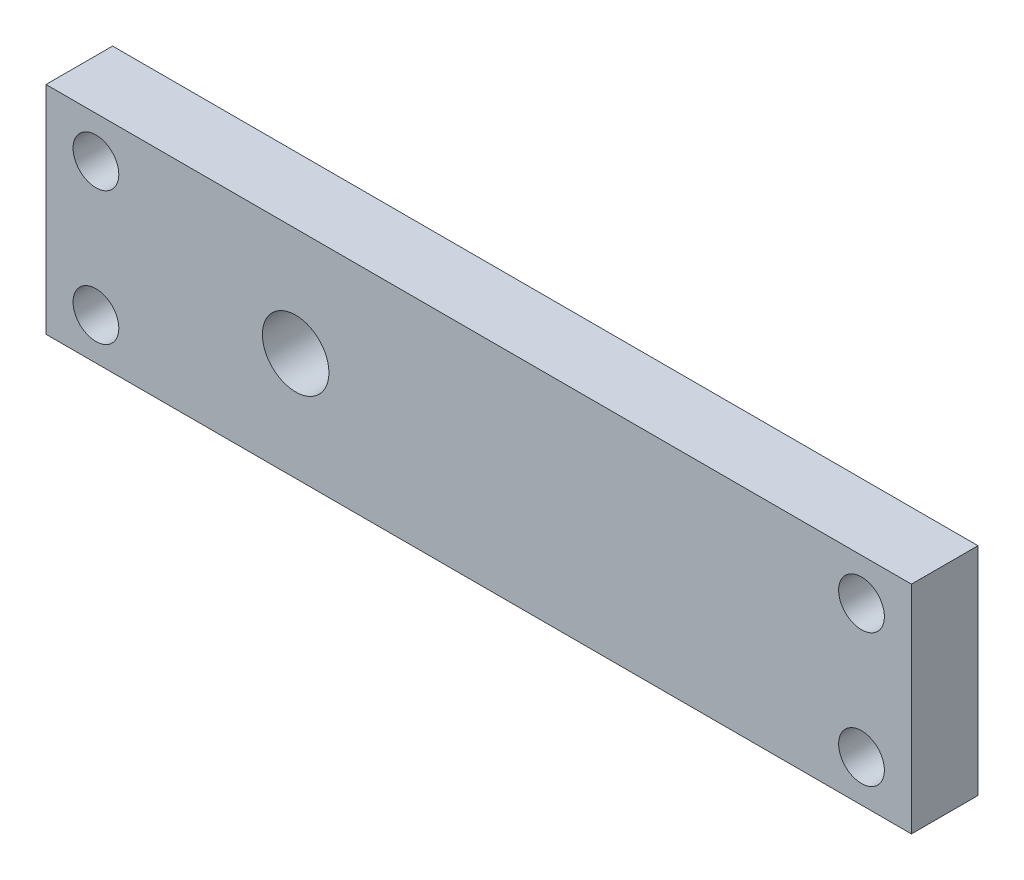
ISO-10303-21;
HEADER;
FILE_DESCRIPTION(('STEP AP214'),'2;1');
FILE_NAME('part.step','',(''),(''),'','','');
FILE_SCHEMA(('AUTOMOTIVE_DESIGN { 1 0 10303 214 1 1 1 1 }'));
ENDSEC;
DATA;
#1=APPLICATION_CONTEXT('core data for automotive mechanical design processes');
#2=APPLICATION_PROTOCOL_DEFINITION('international standard','automotive_design',2000,#1);
#3=PRODUCT_CONTEXT('',#1,'mechanical');
#4=PRODUCT('Part','Part','',(#3));
#5=PRODUCT_RELATED_PRODUCT_CATEGORY('part','',(#4));
#6=PRODUCT_DEFINITION_FORMATION('','',#4);
#7=PRODUCT_DEFINITION_CONTEXT('part definition',#1,'design');
#8=PRODUCT_DEFINITION('design','',#6,#7);
#9=PRODUCT_DEFINITION_SHAPE('','',#8);
#10=(LENGTH_UNIT() NAMED_UNIT(*) SI_UNIT(.MILLI.,.METRE.));
#11=(NAMED_UNIT(*) PLANE_ANGLE_UNIT() SI_UNIT($,.RADIAN.));
#12=(NAMED_UNIT(*) SI_UNIT($,.STERADIAN.) SOLID_ANGLE_UNIT());
#13=UNCERTAINTY_MEASURE_WITH_UNIT(LENGTH_MEASURE(1.E-05),#10,'distance_accuracy_value','');
#14=(GEOMETRIC_REPRESENTATION_CONTEXT(3) GLOBAL_UNCERTAINTY_ASSIGNED_CONTEXT((#13)) GLOBAL_UNIT_ASSIGNED_CONTEXT((#10,
#11,#12)) REPRESENTATION_CONTEXT('',''));
#15=CARTESIAN_POINT('',(0.,0.,0.));
#16=DIRECTION('',(0.,0.,1.));
#17=DIRECTION('',(1.,0.,0.));
#18=AXIS2_PLACEMENT_3D('',#15,#16,#17);
#19=CARTESIAN_POINT('',(0.,0.,8.00000000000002));
#20=DIRECTION('',(1.,0.,0.));
#21=DIRECTION('',(0.,0.,-1.));
#22=AXIS2_PLACEMENT_3D('',#19,#20,#21);
#23=PLANE('',#22);
#24=DIRECTION('',(0.,-1.,0.));
#25=VECTOR('',#24,1.);
#26=CARTESIAN_POINT('',(0.,0.,0.));
#27=LINE('',#26,#25);
#28=CARTESIAN_POINT('',(0.,26.,0.));
#29=VERTEX_POINT('',#28);
#30=CARTESIAN_POINT('',(0.,0.,0.));
#31=VERTEX_POINT('',#30);
#32=EDGE_CURVE('E96',#29,#31,#27,.T.);
#33=ORIENTED_EDGE('',*,*,#32,.T.);
#34=DIRECTION('',(0.,0.,-1.));
#35=VECTOR('',#34,1.);
#36=CARTESIAN_POINT('',(0.,0.,8.00000000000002));
#37=LINE('',#36,#35);
#38=CARTESIAN_POINT('',(0.,0.,8.00000000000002));
#39=VERTEX_POINT('',#38);
#40=EDGE_CURVE('E11',#39,#31,#37,.T.);
#41=ORIENTED_EDGE('',*,*,#40,.F.);
#42=DIRECTION('',(0.,-1.,0.));
#43=VECTOR('',#42,1.);
#44=CARTESIAN_POINT('',(0.,0.,8.00000000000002));
#45=LINE('',#44,#43);
#46=CARTESIAN_POINT('',(0.,26.,8.00000000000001));
#47=VERTEX_POINT('',#46);
#48=EDGE_CURVE('E83',#47,#39,#45,.T.);
#49=ORIENTED_EDGE('',*,*,#48,.F.);
#50=DIRECTION('',(0.,0.,-1.));
#51=VECTOR('',#50,1.);
#52=CARTESIAN_POINT('',(0.,26.,8.00000000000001));
#53=LINE('',#52,#51);
#54=EDGE_CURVE('E92',#47,#29,#53,.T.);
#55=ORIENTED_EDGE('',*,*,#54,.T.);
#56=EDGE_LOOP('',(#33,#41,#49,#55));
#57=FACE_BOUND('',#56,.T.);
#58=ADVANCED_FACE('F30',(#57),#23,.F.);
#59=CARTESIAN_POINT('',(0.,0.,8.00000000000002));
#60=DIRECTION('',(0.,1.,0.));
#61=DIRECTION('',(0.,0.,1.));
#62=AXIS2_PLACEMENT_3D('',#59,#60,#61);
#63=PLANE('',#62);
#64=DIRECTION('',(0.999999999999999,0.,0.));
#65=VECTOR('',#64,1.);
#66=CARTESIAN_POINT('',(0.,0.,0.));
#67=LINE('',#66,#65);
#68=CARTESIAN_POINT('',(104.,0.,0.));
#69=VERTEX_POINT('',#68);
#70=EDGE_CURVE('E87',#31,#69,#67,.T.);
#71=ORIENTED_EDGE('',*,*,#70,.T.);
#72=DIRECTION('',(0.,0.,-1.));
#73=VECTOR('',#72,1.);
#74=CARTESIAN_POINT('',(104.,0.,8.00000000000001));
#75=LINE('',#74,#73);
#76=CARTESIAN_POINT('',(104.,0.,8.00000000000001));
#77=VERTEX_POINT('',#76);
#78=EDGE_CURVE('E39',#77,#69,#75,.T.);
#79=ORIENTED_EDGE('',*,*,#78,.F.);
#80=DIRECTION('',(0.999999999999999,0.,0.));
#81=VECTOR('',#80,1.);
#82=CARTESIAN_POINT('',(0.,0.,8.00000000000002));
#83=LINE('',#82,#81);
#84=EDGE_CURVE('E78',#39,#77,#83,.T.);
#85=ORIENTED_EDGE('',*,*,#84,.F.);
#86=ORIENTED_EDGE('',*,*,#40,.T.);
#87=EDGE_LOOP('',(#71,#79,#85,#86));
#88=FACE_BOUND('',#87,.T.);
#89=ADVANCED_FACE('F86',(#88),#63,.F.);
#90=CARTESIAN_POINT('',(104.,0.,8.00000000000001));
#91=DIRECTION('',(-1.,0.,0.));
#92=DIRECTION('',(0.,0.,1.));
#93=AXIS2_PLACEMENT_3D('',#90,#91,#92);
#94=PLANE('',#93);
#95=DIRECTION('',(0.,1.,0.));
#96=VECTOR('',#95,1.);
#97=CARTESIAN_POINT('',(104.,0.,0.));
#98=LINE('',#97,#96);
#99=CARTESIAN_POINT('',(104.,26.,0.));
#100=VERTEX_POINT('',#99);
#101=EDGE_CURVE('E65',#69,#100,#98,.T.);
#102=ORIENTED_EDGE('',*,*,#101,.T.);
#103=DIRECTION('',(0.,0.,-1.));
#104=VECTOR('',#103,1.);
#105=CARTESIAN_POINT('',(104.,26.,8.00000000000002));
#106=LINE('',#105,#104);
#107=CARTESIAN_POINT('',(104.,26.,8.00000000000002));
#108=VERTEX_POINT('',#107);
#109=EDGE_CURVE('E88',#108,#100,#106,.T.);
#110=ORIENTED_EDGE('',*,*,#109,.F.);
#111=DIRECTION('',(0.,1.,0.));
#112=VECTOR('',#111,1.);
#113=CARTESIAN_POINT('',(104.,0.,8.00000000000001));
#114=LINE('',#113,#112);
#115=EDGE_CURVE('E81',#77,#108,#114,.T.);
#116=ORIENTED_EDGE('',*,*,#115,.F.);
#117=ORIENTED_EDGE('',*,*,#78,.T.);
#118=EDGE_LOOP('',(#102,#110,#116,#117));
#119=FACE_BOUND('',#118,.T.);
#120=ADVANCED_FACE('F90',(#119),#94,.F.);
#121=CARTESIAN_POINT('',(0.,26.,8.00000000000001));
#122=DIRECTION('',(0.,-1.,0.));
#123=DIRECTION('',(0.,0.,-1.));
#124=AXIS2_PLACEMENT_3D('',#121,#122,#123);
#125=PLANE('',#124);
#126=DIRECTION('',(-0.999999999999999,0.,0.));
#127=VECTOR('',#126,1.);
#128=CARTESIAN_POINT('',(0.,26.,0.));
#129=LINE('',#128,#127);
#130=EDGE_CURVE('E71',#100,#29,#129,.T.);
#131=ORIENTED_EDGE('',*,*,#130,.T.);
#132=ORIENTED_EDGE('',*,*,#54,.F.);
#133=DIRECTION('',(-0.999999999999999,0.,0.));
#134=VECTOR('',#133,1.);
#135=CARTESIAN_POINT('',(0.,26.,8.00000000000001));
#136=LINE('',#135,#134);
#137=EDGE_CURVE('E48',#108,#47,#136,.T.);
#138=ORIENTED_EDGE('',*,*,#137,.F.);
#139=ORIENTED_EDGE('',*,*,#109,.T.);
#140=EDGE_LOOP('',(#131,#132,#138,#139));
#141=FACE_BOUND('',#140,.T.);
#142=ADVANCED_FACE('F139',(#141),#125,.F.);
#143=CARTESIAN_POINT('',(0.,26.,8.00000000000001));
#144=DIRECTION('',(0.,0.,-1.));
#145=DIRECTION('',(-1.,0.,0.));
#146=AXIS2_PLACEMENT_3D('',#143,#144,#145);
#147=PLANE('',#146);
#148=CARTESIAN_POINT('',(5.99999999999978,21.,8.00000000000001));
#149=DIRECTION('',(0.,0.,1.));
#150=DIRECTION('',(1.,0.,0.));
#151=AXIS2_PLACEMENT_3D('',#148,#149,#150);
#152=CIRCLE('',#151,2.74999999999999);
#153=CARTESIAN_POINT('',(8.74999999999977,21.,8.00000000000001));
#154=VERTEX_POINT('',#153);
#155=EDGE_CURVE('E125',#154,#154,#152,.T.);
#156=ORIENTED_EDGE('',*,*,#155,.F.);
#157=EDGE_LOOP('',(#156));
#158=FACE_BOUND('',#157,.T.);
#159=CARTESIAN_POINT('',(6.00000000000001,4.99999999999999,8.00000000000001));
#160=DIRECTION('',(0.,0.,1.));
#161=DIRECTION('',(1.,0.,0.));
#162=AXIS2_PLACEMENT_3D('',#159,#160,#161);
#163=CIRCLE('',#162,2.74999999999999);
#164=CARTESIAN_POINT('',(8.74999999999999,4.99999999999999,8.00000000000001));
#165=VERTEX_POINT('',#164);
#166=EDGE_CURVE('E115',#165,#165,#163,.T.);
#167=ORIENTED_EDGE('',*,*,#166,.F.);
#168=EDGE_LOOP('',(#167));
#169=FACE_BOUND('',#168,.T.);
#170=CARTESIAN_POINT('',(97.9999999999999,21.,8.00000000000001));
#171=DIRECTION('',(0.,0.,1.));
#172=DIRECTION('',(1.,0.,0.));
#173=AXIS2_PLACEMENT_3D('',#170,#171,#172);
#174=CIRCLE('',#173,2.74999999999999);
#175=CARTESIAN_POINT('',(100.75,21.,8.00000000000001));
#176=VERTEX_POINT('',#175);
#177=EDGE_CURVE('E112',#176,#176,#174,.T.);
#178=ORIENTED_EDGE('',*,*,#177,.F.);
#179=EDGE_LOOP('',(#178));
#180=FACE_BOUND('',#179,.T.);
#181=CARTESIAN_POINT('',(98.0000000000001,4.99999999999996,8.00000000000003));
#182=DIRECTION('',(0.,0.,1.));
#183=DIRECTION('',(1.,0.,0.));
#184=AXIS2_PLACEMENT_3D('',#181,#182,#183);
#185=CIRCLE('',#184,2.74999999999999);
#186=CARTESIAN_POINT('',(100.75,4.99999999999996,8.00000000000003));
#187=VERTEX_POINT('',#186);
#188=EDGE_CURVE('E109',#187,#187,#185,.T.);
#189=ORIENTED_EDGE('',*,*,#188,.F.);
#190=EDGE_LOOP('',(#189));
#191=FACE_BOUND('',#190,.T.);
#192=CARTESIAN_POINT('',(30.,13.,8.00000000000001));
#193=DIRECTION('',(0.,0.,1.));
#194=DIRECTION('',(1.,0.,0.));
#195=AXIS2_PLACEMENT_3D('',#192,#193,#194);
#196=CIRCLE('',#195,4.00000000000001);
#197=CARTESIAN_POINT('',(34.,13.,8.00000000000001));
#198=VERTEX_POINT('',#197);
#199=EDGE_CURVE('E108',#198,#198,#196,.T.);
#200=ORIENTED_EDGE('',*,*,#199,.F.);
#201=EDGE_LOOP('',(#200));
#202=FACE_BOUND('',#201,.T.);
#203=ORIENTED_EDGE('',*,*,#48,.T.);
#204=ORIENTED_EDGE('',*,*,#84,.T.);
#205=ORIENTED_EDGE('',*,*,#115,.T.);
#206=ORIENTED_EDGE('',*,*,#137,.T.);
#207=EDGE_LOOP('',(#203,#204,#205,#206));
#208=FACE_BOUND('',#207,.T.);
#209=ADVANCED_FACE('F79',(#158,#169,#180,#191,#202,#208),#147,.F.);
#210=CARTESIAN_POINT('',(0.,26.,0.));
#211=DIRECTION('',(0.,0.,-1.));
#212=DIRECTION('',(-1.,0.,0.));
#213=AXIS2_PLACEMENT_3D('',#210,#211,#212);
#214=PLANE('',#213);
#215=CARTESIAN_POINT('',(6.00000000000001,21.,0.));
#216=DIRECTION('',(0.,0.,-1.));
#217=DIRECTION('',(-1.,0.,0.));
#218=AXIS2_PLACEMENT_3D('',#215,#216,#217);
#219=CIRCLE('',#218,2.74999999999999);
#220=CARTESIAN_POINT('',(8.74999999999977,21.,0.));
#221=VERTEX_POINT('',#220);
#222=EDGE_CURVE('E33',#221,#221,#219,.T.);
#223=ORIENTED_EDGE('',*,*,#222,.F.);
#224=EDGE_LOOP('',(#223));
#225=FACE_BOUND('',#224,.T.);
#226=CARTESIAN_POINT('',(6.00000000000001,4.99999999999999,0.));
#227=DIRECTION('',(0.,0.,-1.));
#228=DIRECTION('',(-1.,0.,0.));
#229=AXIS2_PLACEMENT_3D('',#226,#227,#228);
#230=CIRCLE('',#229,2.74999999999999);
#231=CARTESIAN_POINT('',(8.74999999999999,4.99999999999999,0.));
#232=VERTEX_POINT('',#231);
#233=EDGE_CURVE('E113',#232,#232,#230,.T.);
#234=ORIENTED_EDGE('',*,*,#233,.F.);
#235=EDGE_LOOP('',(#234));
#236=FACE_BOUND('',#235,.T.);
#237=CARTESIAN_POINT('',(98.0000000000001,21.,0.));
#238=DIRECTION('',(0.,0.,-1.));
#239=DIRECTION('',(-1.,0.,0.));
#240=AXIS2_PLACEMENT_3D('',#237,#238,#239);
#241=CIRCLE('',#240,2.74999999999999);
#242=CARTESIAN_POINT('',(100.75,21.,0.));
#243=VERTEX_POINT('',#242);
#244=EDGE_CURVE('E110',#243,#243,#241,.T.);
#245=ORIENTED_EDGE('',*,*,#244,.F.);
#246=EDGE_LOOP('',(#245));
#247=FACE_BOUND('',#246,.T.);
#248=CARTESIAN_POINT('',(97.9999999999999,4.99999999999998,0.));
#249=DIRECTION('',(0.,0.,-1.));
#250=DIRECTION('',(-1.,0.,0.));
#251=AXIS2_PLACEMENT_3D('',#248,#249,#250);
#252=CIRCLE('',#251,2.74999999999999);
#253=CARTESIAN_POINT('',(100.75,4.99999999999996,0.));
#254=VERTEX_POINT('',#253);
#255=EDGE_CURVE('E105',#254,#254,#252,.T.);
#256=ORIENTED_EDGE('',*,*,#255,.F.);
#257=EDGE_LOOP('',(#256));
#258=FACE_BOUND('',#257,.T.);
#259=CARTESIAN_POINT('',(30.,13.,0.));
#260=DIRECTION('',(0.,0.,1.));
#261=DIRECTION('',(1.,0.,0.));
#262=AXIS2_PLACEMENT_3D('',#259,#260,#261);
#263=CIRCLE('',#262,4.00000000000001);
#264=CARTESIAN_POINT('',(34.,13.,0.));
#265=VERTEX_POINT('',#264);
#266=EDGE_CURVE('E99',#265,#265,#263,.T.);
#267=ORIENTED_EDGE('',*,*,#266,.T.);
#268=EDGE_LOOP('',(#267));
#269=FACE_BOUND('',#268,.T.);
#270=ORIENTED_EDGE('',*,*,#32,.F.);
#271=ORIENTED_EDGE('',*,*,#130,.F.);
#272=ORIENTED_EDGE('',*,*,#101,.F.);
#273=ORIENTED_EDGE('',*,*,#70,.F.);
#274=EDGE_LOOP('',(#270,#271,#272,#273));
#275=FACE_BOUND('',#274,.T.);
#276=ADVANCED_FACE('F138',(#225,#236,#247,#258,#269,#275),#214,.T.);
#277=CARTESIAN_POINT('',(30.,13.,0.));
#278=DIRECTION('',(0.,0.,1.));
#279=DIRECTION('',(1.,0.,0.));
#280=AXIS2_PLACEMENT_3D('',#277,#278,#279);
#281=CYLINDRICAL_SURFACE('',#280,4.00000000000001);
#282=CARTESIAN_POINT('',(34.,13.,0.));
#283=CARTESIAN_POINT('',(34.,13.,0.0833333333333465));
#284=CARTESIAN_POINT('',(34.,13.,0.16666666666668));
#285=CARTESIAN_POINT('',(34.,13.,0.333333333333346));
#286=CARTESIAN_POINT('',(34.,13.,0.41666666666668));
#287=CARTESIAN_POINT('',(34.,13.,0.583333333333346));
#288=CARTESIAN_POINT('',(34.,13.,0.66666666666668));
#289=CARTESIAN_POINT('',(34.,13.,0.833333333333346));
#290=CARTESIAN_POINT('',(34.,13.,0.916666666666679));
#291=CARTESIAN_POINT('',(34.,13.,1.08333333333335));
#292=CARTESIAN_POINT('',(34.,13.,1.16666666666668));
#293=CARTESIAN_POINT('',(34.,13.,1.33333333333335));
#294=CARTESIAN_POINT('',(34.,13.,1.41666666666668));
#295=CARTESIAN_POINT('',(34.,13.,1.58333333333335));
#296=CARTESIAN_POINT('',(34.,13.,1.66666666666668));
#297=CARTESIAN_POINT('',(34.,13.,1.83333333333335));
#298=CARTESIAN_POINT('',(34.,13.,1.91666666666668));
#299=CARTESIAN_POINT('',(34.,13.,2.08333333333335));
#300=CARTESIAN_POINT('',(34.,13.,2.16666666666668));
#301=CARTESIAN_POINT('',(34.,13.,2.33333333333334));
#302=CARTESIAN_POINT('',(34.,13.,2.41666666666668));
#303=CARTESIAN_POINT('',(34.,13.,2.58333333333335));
#304=CARTESIAN_POINT('',(34.,13.,2.66666666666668));
#305=CARTESIAN_POINT('',(34.,13.,2.83333333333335));
#306=CARTESIAN_POINT('',(34.,13.,2.91666666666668));
#307=CARTESIAN_POINT('',(34.,13.,3.08333333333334));
#308=CARTESIAN_POINT('',(34.,13.,3.16666666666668));
#309=CARTESIAN_POINT('',(34.,13.,3.33333333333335));
#310=CARTESIAN_POINT('',(34.,13.,3.41666666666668));
#311=CARTESIAN_POINT('',(34.,13.,3.58333333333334));
#312=CARTESIAN_POINT('',(34.,13.,3.66666666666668));
#313=CARTESIAN_POINT('',(34.,13.,3.83333333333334));
#314=CARTESIAN_POINT('',(34.,13.,3.91666666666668));
#315=CARTESIAN_POINT('',(34.,13.,4.08333333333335));
#316=CARTESIAN_POINT('',(34.,13.,4.16666666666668));
#317=CARTESIAN_POINT('',(34.,13.,4.33333333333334));
#318=CARTESIAN_POINT('',(34.,13.,4.41666666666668));
#319=CARTESIAN_POINT('',(34.,13.,4.58333333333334));
#320=CARTESIAN_POINT('',(34.,13.,4.66666666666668));
#321=CARTESIAN_POINT('',(34.,13.,4.83333333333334));
#322=CARTESIAN_POINT('',(34.,13.,4.91666666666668));
#323=CARTESIAN_POINT('',(34.,13.,5.08333333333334));
#324=CARTESIAN_POINT('',(34.,13.,5.16666666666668));
#325=CARTESIAN_POINT('',(34.,13.,5.33333333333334));
#326=CARTESIAN_POINT('',(34.,13.,5.41666666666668));
#327=CARTESIAN_POINT('',(34.,13.,5.58333333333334));
#328=CARTESIAN_POINT('',(34.,13.,5.66666666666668));
#329=CARTESIAN_POINT('',(34.,13.,5.83333333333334));
#330=CARTESIAN_POINT('',(34.,13.,5.91666666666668));
#331=CARTESIAN_POINT('',(34.,13.,6.08333333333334));
#332=CARTESIAN_POINT('',(34.,13.,6.16666666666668));
#333=CARTESIAN_POINT('',(34.,13.,6.33333333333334));
#334=CARTESIAN_POINT('',(34.,13.,6.41666666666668));
#335=CARTESIAN_POINT('',(34.,13.,6.58333333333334));
#336=CARTESIAN_POINT('',(34.,13.,6.66666666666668));
#337=CARTESIAN_POINT('',(34.,13.,6.83333333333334));
#338=CARTESIAN_POINT('',(34.,13.,6.91666666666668));
#339=CARTESIAN_POINT('',(34.,13.,7.08333333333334));
#340=CARTESIAN_POINT('',(34.,13.,7.16666666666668));
#341=CARTESIAN_POINT('',(34.,13.,7.33333333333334));
#342=CARTESIAN_POINT('',(34.,13.,7.41666666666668));
#343=CARTESIAN_POINT('',(34.,13.,7.58333333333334));
#344=CARTESIAN_POINT('',(34.,13.,7.66666666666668));
#345=CARTESIAN_POINT('',(34.,13.,7.83333333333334));
#346=CARTESIAN_POINT('',(34.,13.,7.91666666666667));
#347=CARTESIAN_POINT('',(34.,13.,8.00000000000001));
#348=B_SPLINE_CURVE_WITH_KNOTS('',3,(#282,#283,#284,#285,#286,#287,#288,#289,#290,#291,#292,
#293,#294,#295,#296,#297,#298,#299,#300,#301,#302,#303,#304,#305,#306,#307,#308,#309,#310,#311,
#312,#313,#314,#315,#316,#317,#318,#319,#320,#321,#322,#323,#324,#325,#326,#327,#328,#329,#330,
#331,#332,#333,#334,#335,#336,#337,#338,#339,#340,#341,#342,#343,#344,#345,#346,#347),
.UNSPECIFIED.,.F.,.F.,(4,2,2,2,2,2,2,2,2,2,2,2,2,2,2,2,2,2,2,2,2,2,2,2,2,2,2,2,2,2,2,2,4),(0.,
0.25,0.5,0.749999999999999,1.,1.25,1.5,1.75,2.,2.25,2.5,2.75,3.,3.25,3.5,3.75,4.,4.25,4.5,4.75,
5.,5.25,5.5,5.75,6.,6.25,6.5,6.75,7.,7.25,7.5,7.75,7.99999999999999),.UNSPECIFIED.);
#349=EDGE_CURVE('BSEAM135',#265,#198,#348,.T.);
#350=ORIENTED_EDGE('',*,*,#266,.F.);
#351=ORIENTED_EDGE('',*,*,#199,.T.);
#352=ORIENTED_EDGE('',*,*,#349,.T.);
#353=ORIENTED_EDGE('',*,*,#349,.F.);
#354=EDGE_LOOP('',(#350,#352,#351,#353));
#355=FACE_BOUND('',#354,.T.);
#356=ADVANCED_FACE('F135',(#355),#281,.F.);
#357=CARTESIAN_POINT('',(98.0000000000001,4.99999999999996,8.00000000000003));
#358=DIRECTION('',(0.,0.,1.));
#359=DIRECTION('',(1.,0.,0.));
#360=AXIS2_PLACEMENT_3D('',#357,#358,#359);
#361=CYLINDRICAL_SURFACE('',#360,2.74999999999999);
#362=CARTESIAN_POINT('',(100.75,4.99999999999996,0.));
#363=CARTESIAN_POINT('',(100.75,4.99999999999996,0.083333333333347));
#364=CARTESIAN_POINT('',(100.75,4.99999999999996,0.16666666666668));
#365=CARTESIAN_POINT('',(100.75,4.99999999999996,0.333333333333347));
#366=CARTESIAN_POINT('',(100.75,4.99999999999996,0.416666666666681));
#367=CARTESIAN_POINT('',(100.75,4.99999999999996,0.583333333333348));
#368=CARTESIAN_POINT('',(100.75,4.99999999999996,0.666666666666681));
#369=CARTESIAN_POINT('',(100.75,4.99999999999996,0.833333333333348));
#370=CARTESIAN_POINT('',(100.75,4.99999999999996,0.916666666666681));
#371=CARTESIAN_POINT('',(100.75,4.99999999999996,1.08333333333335));
#372=CARTESIAN_POINT('',(100.75,4.99999999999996,1.16666666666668));
#373=CARTESIAN_POINT('',(100.75,4.99999999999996,1.33333333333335));
#374=CARTESIAN_POINT('',(100.75,4.99999999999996,1.41666666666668));
#375=CARTESIAN_POINT('',(100.75,4.99999999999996,1.58333333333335));
#376=CARTESIAN_POINT('',(100.75,4.99999999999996,1.66666666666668));
#377=CARTESIAN_POINT('',(100.75,4.99999999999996,1.83333333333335));
#378=CARTESIAN_POINT('',(100.75,4.99999999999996,1.91666666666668));
#379=CARTESIAN_POINT('',(100.75,4.99999999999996,2.08333333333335));
#380=CARTESIAN_POINT('',(100.75,4.99999999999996,2.16666666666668));
#381=CARTESIAN_POINT('',(100.75,4.99999999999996,2.33333333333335));
#382=CARTESIAN_POINT('',(100.75,4.99999999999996,2.41666666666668));
#383=CARTESIAN_POINT('',(100.75,4.99999999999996,2.58333333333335));
#384=CARTESIAN_POINT('',(100.75,4.99999999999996,2.66666666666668));
#385=CARTESIAN_POINT('',(100.75,4.99999999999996,2.83333333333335));
#386=CARTESIAN_POINT('',(100.75,4.99999999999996,2.91666666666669));
#387=CARTESIAN_POINT('',(100.75,4.99999999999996,3.08333333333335));
#388=CARTESIAN_POINT('',(100.75,4.99999999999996,3.16666666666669));
#389=CARTESIAN_POINT('',(100.75,4.99999999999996,3.33333333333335));
#390=CARTESIAN_POINT('',(100.75,4.99999999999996,3.41666666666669));
#391=CARTESIAN_POINT('',(100.75,4.99999999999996,3.58333333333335));
#392=CARTESIAN_POINT('',(100.75,4.99999999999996,3.66666666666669));
#393=CARTESIAN_POINT('',(100.75,4.99999999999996,3.83333333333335));
#394=CARTESIAN_POINT('',(100.75,4.99999999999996,3.91666666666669));
#395=CARTESIAN_POINT('',(100.75,4.99999999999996,4.08333333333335));
#396=CARTESIAN_POINT('',(100.75,4.99999999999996,4.16666666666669));
#397=CARTESIAN_POINT('',(100.75,4.99999999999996,4.33333333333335));
#398=CARTESIAN_POINT('',(100.75,4.99999999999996,4.41666666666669));
#399=CARTESIAN_POINT('',(100.75,4.99999999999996,4.58333333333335));
#400=CARTESIAN_POINT('',(100.75,4.99999999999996,4.66666666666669));
#401=CARTESIAN_POINT('',(100.75,4.99999999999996,4.83333333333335));
#402=CARTESIAN_POINT('',(100.75,4.99999999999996,4.91666666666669));
#403=CARTESIAN_POINT('',(100.75,4.99999999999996,5.08333333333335));
#404=CARTESIAN_POINT('',(100.75,4.99999999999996,5.16666666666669));
#405=CARTESIAN_POINT('',(100.75,4.99999999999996,5.33333333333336));
#406=CARTESIAN_POINT('',(100.75,4.99999999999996,5.41666666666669));
#407=CARTESIAN_POINT('',(100.75,4.99999999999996,5.58333333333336));
#408=CARTESIAN_POINT('',(100.75,4.99999999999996,5.66666666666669));
#409=CARTESIAN_POINT('',(100.75,4.99999999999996,5.83333333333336));
#410=CARTESIAN_POINT('',(100.75,4.99999999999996,5.91666666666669));
#411=CARTESIAN_POINT('',(100.75,4.99999999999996,6.08333333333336));
#412=CARTESIAN_POINT('',(100.75,4.99999999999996,6.16666666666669));
#413=CARTESIAN_POINT('',(100.75,4.99999999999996,6.33333333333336));
#414=CARTESIAN_POINT('',(100.75,4.99999999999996,6.41666666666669));
#415=CARTESIAN_POINT('',(100.75,4.99999999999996,6.58333333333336));
#416=CARTESIAN_POINT('',(100.75,4.99999999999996,6.66666666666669));
#417=CARTESIAN_POINT('',(100.75,4.99999999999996,6.83333333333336));
#418=CARTESIAN_POINT('',(100.75,4.99999999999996,6.91666666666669));
#419=CARTESIAN_POINT('',(100.75,4.99999999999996,7.08333333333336));
#420=CARTESIAN_POINT('',(100.75,4.99999999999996,7.16666666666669));
#421=CARTESIAN_POINT('',(100.75,4.99999999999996,7.33333333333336));
#422=CARTESIAN_POINT('',(100.75,4.99999999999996,7.41666666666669));
#423=CARTESIAN_POINT('',(100.75,4.99999999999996,7.58333333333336));
#424=CARTESIAN_POINT('',(100.75,4.99999999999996,7.66666666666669));
#425=CARTESIAN_POINT('',(100.75,4.99999999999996,7.83333333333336));
#426=CARTESIAN_POINT('',(100.75,4.99999999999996,7.91666666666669));
#427=CARTESIAN_POINT('',(100.75,4.99999999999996,8.00000000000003));
#428=B_SPLINE_CURVE_WITH_KNOTS('',3,(#362,#363,#364,#365,#366,#367,#368,#369,#370,#371,#372,
#373,#374,#375,#376,#377,#378,#379,#380,#381,#382,#383,#384,#385,#386,#387,#388,#389,#390,#391,
#392,#393,#394,#395,#396,#397,#398,#399,#400,#401,#402,#403,#404,#405,#406,#407,#408,#409,#410,
#411,#412,#413,#414,#415,#416,#417,#418,#419,#420,#421,#422,#423,#424,#425,#426,#427),
.UNSPECIFIED.,.F.,.F.,(4,2,2,2,2,2,2,2,2,2,2,2,2,2,2,2,2,2,2,2,2,2,2,2,2,2,2,2,2,2,2,2,4),(0.,
0.249999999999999,0.5,0.750000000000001,1.,1.25,1.5,1.75,2.,2.25,2.5,2.75,3.,3.25,3.5,3.75,
4.00000000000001,4.25000000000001,4.50000000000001,4.75000000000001,5.00000000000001,
5.25000000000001,5.50000000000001,5.75000000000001,6.00000000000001,6.25000000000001,
6.50000000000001,6.75000000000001,7.00000000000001,7.25000000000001,7.50000000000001,
7.75000000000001,8.00000000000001),.UNSPECIFIED.);
#429=EDGE_CURVE('BSEAM182',#254,#187,#428,.T.);
#430=ORIENTED_EDGE('',*,*,#255,.T.);
#431=ORIENTED_EDGE('',*,*,#188,.T.);
#432=ORIENTED_EDGE('',*,*,#429,.T.);
#433=ORIENTED_EDGE('',*,*,#429,.F.);
#434=EDGE_LOOP('',(#430,#432,#431,#433));
#435=FACE_BOUND('',#434,.T.);
#436=ADVANCED_FACE('F182',(#435),#361,.F.);
#437=CARTESIAN_POINT('',(97.9999999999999,21.,8.00000000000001));
#438=DIRECTION('',(0.,0.,1.));
#439=DIRECTION('',(1.,0.,0.));
#440=AXIS2_PLACEMENT_3D('',#437,#438,#439);
#441=CYLINDRICAL_SURFACE('',#440,2.74999999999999);
#442=CARTESIAN_POINT('',(100.75,21.,0.));
#443=CARTESIAN_POINT('',(100.75,21.,0.0833333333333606));
#444=CARTESIAN_POINT('',(100.75,21.,0.166666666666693));
#445=CARTESIAN_POINT('',(100.75,21.,0.333333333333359));
#446=CARTESIAN_POINT('',(100.75,21.,0.416666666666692));
#447=CARTESIAN_POINT('',(100.75,21.,0.583333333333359));
#448=CARTESIAN_POINT('',(100.75,21.,0.666666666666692));
#449=CARTESIAN_POINT('',(100.75,21.,0.833333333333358));
#450=CARTESIAN_POINT('',(100.75,21.,0.916666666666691));
#451=CARTESIAN_POINT('',(100.75,21.,1.08333333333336));
#452=CARTESIAN_POINT('',(100.75,21.,1.16666666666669));
#453=CARTESIAN_POINT('',(100.75,21.,1.33333333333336));
#454=CARTESIAN_POINT('',(100.75,21.,1.41666666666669));
#455=CARTESIAN_POINT('',(100.75,21.,1.58333333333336));
#456=CARTESIAN_POINT('',(100.75,21.,1.66666666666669));
#457=CARTESIAN_POINT('',(100.75,21.,1.83333333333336));
#458=CARTESIAN_POINT('',(100.75,21.,1.91666666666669));
#459=CARTESIAN_POINT('',(100.75,21.,2.08333333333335));
#460=CARTESIAN_POINT('',(100.75,21.,2.16666666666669));
#461=CARTESIAN_POINT('',(100.75,21.,2.33333333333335));
#462=CARTESIAN_POINT('',(100.75,21.,2.41666666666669));
#463=CARTESIAN_POINT('',(100.75,21.,2.58333333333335));
#464=CARTESIAN_POINT('',(100.75,21.,2.66666666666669));
#465=CARTESIAN_POINT('',(100.75,21.,2.83333333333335));
#466=CARTESIAN_POINT('',(100.75,21.,2.91666666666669));
#467=CARTESIAN_POINT('',(100.75,21.,3.08333333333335));
#468=CARTESIAN_POINT('',(100.75,21.,3.16666666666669));
#469=CARTESIAN_POINT('',(100.75,21.,3.33333333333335));
#470=CARTESIAN_POINT('',(100.75,21.,3.41666666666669));
#471=CARTESIAN_POINT('',(100.75,21.,3.58333333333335));
#472=CARTESIAN_POINT('',(100.75,21.,3.66666666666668));
#473=CARTESIAN_POINT('',(100.75,21.,3.83333333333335));
#474=CARTESIAN_POINT('',(100.75,21.,3.91666666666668));
#475=CARTESIAN_POINT('',(100.75,21.,4.08333333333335));
#476=CARTESIAN_POINT('',(100.75,21.,4.16666666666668));
#477=CARTESIAN_POINT('',(100.75,21.,4.33333333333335));
#478=CARTESIAN_POINT('',(100.75,21.,4.41666666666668));
#479=CARTESIAN_POINT('',(100.75,21.,4.58333333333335));
#480=CARTESIAN_POINT('',(100.75,21.,4.66666666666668));
#481=CARTESIAN_POINT('',(100.75,21.,4.83333333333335));
#482=CARTESIAN_POINT('',(100.75,21.,4.91666666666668));
#483=CARTESIAN_POINT('',(100.75,21.,5.08333333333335));
#484=CARTESIAN_POINT('',(100.75,21.,5.16666666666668));
#485=CARTESIAN_POINT('',(100.75,21.,5.33333333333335));
#486=CARTESIAN_POINT('',(100.75,21.,5.41666666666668));
#487=CARTESIAN_POINT('',(100.75,21.,5.58333333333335));
#488=CARTESIAN_POINT('',(100.75,21.,5.66666666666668));
#489=CARTESIAN_POINT('',(100.75,21.,5.83333333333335));
#490=CARTESIAN_POINT('',(100.75,21.,5.91666666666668));
#491=CARTESIAN_POINT('',(100.75,21.,6.08333333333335));
#492=CARTESIAN_POINT('',(100.75,21.,6.16666666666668));
#493=CARTESIAN_POINT('',(100.75,21.,6.33333333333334));
#494=CARTESIAN_POINT('',(100.75,21.,6.41666666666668));
#495=CARTESIAN_POINT('',(100.75,21.,6.58333333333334));
#496=CARTESIAN_POINT('',(100.75,21.,6.66666666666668));
#497=CARTESIAN_POINT('',(100.75,21.,6.83333333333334));
#498=CARTESIAN_POINT('',(100.75,21.,6.91666666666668));
#499=CARTESIAN_POINT('',(100.75,21.,7.08333333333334));
#500=CARTESIAN_POINT('',(100.75,21.,7.16666666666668));
#501=CARTESIAN_POINT('',(100.75,21.,7.33333333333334));
#502=CARTESIAN_POINT('',(100.75,21.,7.41666666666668));
#503=CARTESIAN_POINT('',(100.75,21.,7.58333333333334));
#504=CARTESIAN_POINT('',(100.75,21.,7.66666666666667));
#505=CARTESIAN_POINT('',(100.75,21.,7.83333333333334));
#506=CARTESIAN_POINT('',(100.75,21.,7.91666666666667));
#507=CARTESIAN_POINT('',(100.75,21.,8.00000000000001));
#508=B_SPLINE_CURVE_WITH_KNOTS('',3,(#442,#443,#444,#445,#446,#447,#448,#449,#450,#451,#452,
#453,#454,#455,#456,#457,#458,#459,#460,#461,#462,#463,#464,#465,#466,#467,#468,#469,#470,#471,
#472,#473,#474,#475,#476,#477,#478,#479,#480,#481,#482,#483,#484,#485,#486,#487,#488,#489,#490,
#491,#492,#493,#494,#495,#496,#497,#498,#499,#500,#501,#502,#503,#504,#505,#506,#507),
.UNSPECIFIED.,.F.,.F.,(4,2,2,2,2,2,2,2,2,2,2,2,2,2,2,2,2,2,2,2,2,2,2,2,2,2,2,2,2,2,2,2,4),(0.,
0.249999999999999,0.499999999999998,0.749999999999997,0.999999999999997,1.25,1.5,
1.74999999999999,1.99999999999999,2.24999999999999,2.49999999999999,2.74999999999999,
2.99999999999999,3.24999999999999,3.49999999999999,3.74999999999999,3.99999999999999,
4.24999999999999,4.49999999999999,4.74999999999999,4.99999999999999,5.24999999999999,
5.49999999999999,5.74999999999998,5.99999999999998,6.24999999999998,6.49999999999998,
6.74999999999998,6.99999999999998,7.24999999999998,7.49999999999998,7.74999999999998,
7.99999999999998),.UNSPECIFIED.);
#509=EDGE_CURVE('BSEAM189',#243,#176,#508,.T.);
#510=ORIENTED_EDGE('',*,*,#244,.T.);
#511=ORIENTED_EDGE('',*,*,#177,.T.);
#512=ORIENTED_EDGE('',*,*,#509,.T.);
#513=ORIENTED_EDGE('',*,*,#509,.F.);
#514=EDGE_LOOP('',(#510,#512,#511,#513));
#515=FACE_BOUND('',#514,.T.);
#516=ADVANCED_FACE('F189',(#515),#441,.F.);
#517=CARTESIAN_POINT('',(6.00000000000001,4.99999999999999,8.00000000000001));
#518=DIRECTION('',(0.,0.,1.));
#519=DIRECTION('',(1.,0.,0.));
#520=AXIS2_PLACEMENT_3D('',#517,#518,#519);
#521=CYLINDRICAL_SURFACE('',#520,2.74999999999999);
#522=CARTESIAN_POINT('',(8.74999999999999,4.99999999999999,0.));
#523=CARTESIAN_POINT('',(8.74999999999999,4.99999999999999,0.0833333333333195));
#524=CARTESIAN_POINT('',(8.74999999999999,4.99999999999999,0.166666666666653));
#525=CARTESIAN_POINT('',(8.74999999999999,4.99999999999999,0.33333333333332));
#526=CARTESIAN_POINT('',(8.74999999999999,4.99999999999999,0.416666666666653));
#527=CARTESIAN_POINT('',(8.74999999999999,4.99999999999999,0.58333333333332));
#528=CARTESIAN_POINT('',(8.74999999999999,4.99999999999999,0.666666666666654));
#529=CARTESIAN_POINT('',(8.74999999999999,4.99999999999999,0.833333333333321));
#530=CARTESIAN_POINT('',(8.74999999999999,4.99999999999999,0.916666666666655));
#531=CARTESIAN_POINT('',(8.74999999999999,4.99999999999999,1.08333333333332));
#532=CARTESIAN_POINT('',(8.74999999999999,4.99999999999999,1.16666666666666));
#533=CARTESIAN_POINT('',(8.74999999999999,4.99999999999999,1.33333333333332));
#534=CARTESIAN_POINT('',(8.74999999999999,4.99999999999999,1.41666666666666));
#535=CARTESIAN_POINT('',(8.74999999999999,4.99999999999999,1.58333333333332));
#536=CARTESIAN_POINT('',(8.74999999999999,4.99999999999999,1.66666666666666));
#537=CARTESIAN_POINT('',(8.74999999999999,4.99999999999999,1.83333333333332));
#538=CARTESIAN_POINT('',(8.74999999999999,4.99999999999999,1.91666666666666));
#539=CARTESIAN_POINT('',(8.74999999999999,4.99999999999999,2.08333333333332));
#540=CARTESIAN_POINT('',(8.74999999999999,4.99999999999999,2.16666666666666));
#541=CARTESIAN_POINT('',(8.74999999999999,4.99999999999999,2.33333333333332));
#542=CARTESIAN_POINT('',(8.74999999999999,4.99999999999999,2.41666666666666));
#543=CARTESIAN_POINT('',(8.74999999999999,4.99999999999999,2.58333333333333));
#544=CARTESIAN_POINT('',(8.74999999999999,4.99999999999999,2.66666666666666));
#545=CARTESIAN_POINT('',(8.74999999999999,4.99999999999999,2.83333333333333));
#546=CARTESIAN_POINT('',(8.74999999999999,4.99999999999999,2.91666666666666));
#547=CARTESIAN_POINT('',(8.74999999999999,4.99999999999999,3.08333333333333));
#548=CARTESIAN_POINT('',(8.74999999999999,4.99999999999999,3.16666666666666));
#549=CARTESIAN_POINT('',(8.74999999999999,4.99999999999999,3.33333333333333));
#550=CARTESIAN_POINT('',(8.74999999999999,4.99999999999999,3.41666666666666));
#551=CARTESIAN_POINT('',(8.74999999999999,4.99999999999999,3.58333333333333));
#552=CARTESIAN_POINT('',(8.74999999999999,4.99999999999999,3.66666666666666));
#553=CARTESIAN_POINT('',(8.74999999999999,4.99999999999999,3.83333333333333));
#554=CARTESIAN_POINT('',(8.74999999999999,4.99999999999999,3.91666666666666));
#555=CARTESIAN_POINT('',(8.74999999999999,4.99999999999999,4.08333333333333));
#556=CARTESIAN_POINT('',(8.74999999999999,4.99999999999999,4.16666666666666));
#557=CARTESIAN_POINT('',(8.74999999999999,4.99999999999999,4.33333333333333));
#558=CARTESIAN_POINT('',(8.74999999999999,4.99999999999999,4.41666666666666));
#559=CARTESIAN_POINT('',(8.74999999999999,4.99999999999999,4.58333333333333));
#560=CARTESIAN_POINT('',(8.74999999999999,4.99999999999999,4.66666666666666));
#561=CARTESIAN_POINT('',(8.74999999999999,4.99999999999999,4.83333333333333));
#562=CARTESIAN_POINT('',(8.74999999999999,4.99999999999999,4.91666666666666));
#563=CARTESIAN_POINT('',(8.74999999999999,4.99999999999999,5.08333333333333));
#564=CARTESIAN_POINT('',(8.74999999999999,4.99999999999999,5.16666666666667));
#565=CARTESIAN_POINT('',(8.74999999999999,4.99999999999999,5.33333333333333));
#566=CARTESIAN_POINT('',(8.74999999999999,4.99999999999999,5.41666666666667));
#567=CARTESIAN_POINT('',(8.74999999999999,4.99999999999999,5.58333333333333));
#568=CARTESIAN_POINT('',(8.74999999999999,4.99999999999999,5.66666666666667));
#569=CARTESIAN_POINT('',(8.74999999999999,4.99999999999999,5.83333333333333));
#570=CARTESIAN_POINT('',(8.74999999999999,4.99999999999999,5.91666666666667));
#571=CARTESIAN_POINT('',(8.74999999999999,4.99999999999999,6.08333333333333));
#572=CARTESIAN_POINT('',(8.74999999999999,4.99999999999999,6.16666666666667));
#573=CARTESIAN_POINT('',(8.74999999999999,4.99999999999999,6.33333333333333));
#574=CARTESIAN_POINT('',(8.74999999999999,4.99999999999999,6.41666666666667));
#575=CARTESIAN_POINT('',(8.74999999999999,4.99999999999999,6.58333333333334));
#576=CARTESIAN_POINT('',(8.74999999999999,4.99999999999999,6.66666666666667));
#577=CARTESIAN_POINT('',(8.74999999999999,4.99999999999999,6.83333333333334));
#578=CARTESIAN_POINT('',(8.74999999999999,4.99999999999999,6.91666666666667));
#579=CARTESIAN_POINT('',(8.74999999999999,4.99999999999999,7.08333333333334));
#580=CARTESIAN_POINT('',(8.74999999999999,4.99999999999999,7.16666666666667));
#581=CARTESIAN_POINT('',(8.74999999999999,4.99999999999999,7.33333333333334));
#582=CARTESIAN_POINT('',(8.74999999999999,4.99999999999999,7.41666666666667));
#583=CARTESIAN_POINT('',(8.74999999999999,4.99999999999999,7.58333333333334));
#584=CARTESIAN_POINT('',(8.74999999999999,4.99999999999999,7.66666666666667));
#585=CARTESIAN_POINT('',(8.74999999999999,4.99999999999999,7.83333333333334));
#586=CARTESIAN_POINT('',(8.74999999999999,4.99999999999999,7.91666666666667));
#587=CARTESIAN_POINT('',(8.74999999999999,4.99999999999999,8.00000000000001));
#588=B_SPLINE_CURVE_WITH_KNOTS('',3,(#522,#523,#524,#525,#526,#527,#528,#529,#530,#531,#532,
#533,#534,#535,#536,#537,#538,#539,#540,#541,#542,#543,#544,#545,#546,#547,#548,#549,#550,#551,
#552,#553,#554,#555,#556,#557,#558,#559,#560,#561,#562,#563,#564,#565,#566,#567,#568,#569,#570,
#571,#572,#573,#574,#575,#576,#577,#578,#579,#580,#581,#582,#583,#584,#585,#586,#587),
.UNSPECIFIED.,.F.,.F.,(4,2,2,2,2,2,2,2,2,2,2,2,2,2,2,2,2,2,2,2,2,2,2,2,2,2,2,2,2,2,2,2,4),(0.,
0.25,0.5,0.750000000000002,1.,1.25,1.5,1.75,2.,2.25,2.50000000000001,2.75000000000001,
3.00000000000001,3.25000000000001,3.50000000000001,3.75000000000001,4.00000000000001,
4.25000000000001,4.50000000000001,4.75000000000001,5.00000000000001,5.25000000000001,
5.50000000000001,5.75000000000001,6.00000000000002,6.25000000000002,6.50000000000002,
6.75000000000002,7.00000000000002,7.25000000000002,7.50000000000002,7.75000000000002,
8.00000000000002),.UNSPECIFIED.);
#589=EDGE_CURVE('BSEAM197',#232,#165,#588,.T.);
#590=ORIENTED_EDGE('',*,*,#233,.T.);
#591=ORIENTED_EDGE('',*,*,#166,.T.);
#592=ORIENTED_EDGE('',*,*,#589,.T.);
#593=ORIENTED_EDGE('',*,*,#589,.F.);
#594=EDGE_LOOP('',(#590,#592,#591,#593));
#595=FACE_BOUND('',#594,.T.);
#596=ADVANCED_FACE('F197',(#595),#521,.F.);
#597=CARTESIAN_POINT('',(5.99999999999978,21.,8.00000000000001));
#598=DIRECTION('',(0.,0.,1.));
#599=DIRECTION('',(1.,0.,0.));
#600=AXIS2_PLACEMENT_3D('',#597,#598,#599);
#601=CYLINDRICAL_SURFACE('',#600,2.74999999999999);
#602=CARTESIAN_POINT('',(8.74999999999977,21.,0.));
#603=CARTESIAN_POINT('',(8.74999999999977,21.,0.083333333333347));
#604=CARTESIAN_POINT('',(8.74999999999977,21.,0.16666666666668));
#605=CARTESIAN_POINT('',(8.74999999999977,21.,0.333333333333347));
#606=CARTESIAN_POINT('',(8.74999999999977,21.,0.41666666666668));
#607=CARTESIAN_POINT('',(8.74999999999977,21.,0.583333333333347));
#608=CARTESIAN_POINT('',(8.74999999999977,21.,0.66666666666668));
#609=CARTESIAN_POINT('',(8.74999999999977,21.,0.833333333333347));
#610=CARTESIAN_POINT('',(8.74999999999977,21.,0.91666666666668));
#611=CARTESIAN_POINT('',(8.74999999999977,21.,1.08333333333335));
#612=CARTESIAN_POINT('',(8.74999999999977,21.,1.16666666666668));
#613=CARTESIAN_POINT('',(8.74999999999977,21.,1.33333333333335));
#614=CARTESIAN_POINT('',(8.74999999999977,21.,1.41666666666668));
#615=CARTESIAN_POINT('',(8.74999999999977,21.,1.58333333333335));
#616=CARTESIAN_POINT('',(8.74999999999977,21.,1.66666666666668));
#617=CARTESIAN_POINT('',(8.74999999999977,21.,1.83333333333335));
#618=CARTESIAN_POINT('',(8.74999999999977,21.,1.91666666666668));
#619=CARTESIAN_POINT('',(8.74999999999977,21.,2.08333333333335));
#620=CARTESIAN_POINT('',(8.74999999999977,21.,2.16666666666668));
#621=CARTESIAN_POINT('',(8.74999999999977,21.,2.33333333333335));
#622=CARTESIAN_POINT('',(8.74999999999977,21.,2.41666666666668));
#623=CARTESIAN_POINT('',(8.74999999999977,21.,2.58333333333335));
#624=CARTESIAN_POINT('',(8.74999999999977,21.,2.66666666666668));
#625=CARTESIAN_POINT('',(8.74999999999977,21.,2.83333333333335));
#626=CARTESIAN_POINT('',(8.74999999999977,21.,2.91666666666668));
#627=CARTESIAN_POINT('',(8.74999999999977,21.,3.08333333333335));
#628=CARTESIAN_POINT('',(8.74999999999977,21.,3.16666666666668));
#629=CARTESIAN_POINT('',(8.74999999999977,21.,3.33333333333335));
#630=CARTESIAN_POINT('',(8.74999999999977,21.,3.41666666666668));
#631=CARTESIAN_POINT('',(8.74999999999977,21.,3.58333333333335));
#632=CARTESIAN_POINT('',(8.74999999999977,21.,3.66666666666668));
#633=CARTESIAN_POINT('',(8.74999999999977,21.,3.83333333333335));
#634=CARTESIAN_POINT('',(8.74999999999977,21.,3.91666666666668));
#635=CARTESIAN_POINT('',(8.74999999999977,21.,4.08333333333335));
#636=CARTESIAN_POINT('',(8.74999999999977,21.,4.16666666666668));
#637=CARTESIAN_POINT('',(8.74999999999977,21.,4.33333333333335));
#638=CARTESIAN_POINT('',(8.74999999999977,21.,4.41666666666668));
#639=CARTESIAN_POINT('',(8.74999999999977,21.,4.58333333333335));
#640=CARTESIAN_POINT('',(8.74999999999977,21.,4.66666666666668));
#641=CARTESIAN_POINT('',(8.74999999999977,21.,4.83333333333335));
#642=CARTESIAN_POINT('',(8.74999999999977,21.,4.91666666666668));
#643=CARTESIAN_POINT('',(8.74999999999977,21.,5.08333333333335));
#644=CARTESIAN_POINT('',(8.74999999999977,21.,5.16666666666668));
#645=CARTESIAN_POINT('',(8.74999999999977,21.,5.33333333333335));
#646=CARTESIAN_POINT('',(8.74999999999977,21.,5.41666666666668));
#647=CARTESIAN_POINT('',(8.74999999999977,21.,5.58333333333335));
#648=CARTESIAN_POINT('',(8.74999999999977,21.,5.66666666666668));
#649=CARTESIAN_POINT('',(8.74999999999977,21.,5.83333333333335));
#650=CARTESIAN_POINT('',(8.74999999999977,21.,5.91666666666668));
#651=CARTESIAN_POINT('',(8.74999999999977,21.,6.08333333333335));
#652=CARTESIAN_POINT('',(8.74999999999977,21.,6.16666666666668));
#653=CARTESIAN_POINT('',(8.74999999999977,21.,6.33333333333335));
#654=CARTESIAN_POINT('',(8.74999999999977,21.,6.41666666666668));
#655=CARTESIAN_POINT('',(8.74999999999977,21.,6.58333333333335));
#656=CARTESIAN_POINT('',(8.74999999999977,21.,6.66666666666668));
#657=CARTESIAN_POINT('',(8.74999999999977,21.,6.83333333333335));
#658=CARTESIAN_POINT('',(8.74999999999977,21.,6.91666666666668));
#659=CARTESIAN_POINT('',(8.74999999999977,21.,7.08333333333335));
#660=CARTESIAN_POINT('',(8.74999999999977,21.,7.16666666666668));
#661=CARTESIAN_POINT('',(8.74999999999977,21.,7.33333333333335));
#662=CARTESIAN_POINT('',(8.74999999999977,21.,7.41666666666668));
#663=CARTESIAN_POINT('',(8.74999999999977,21.,7.58333333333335));
#664=CARTESIAN_POINT('',(8.74999999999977,21.,7.66666666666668));
#665=CARTESIAN_POINT('',(8.74999999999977,21.,7.83333333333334));
#666=CARTESIAN_POINT('',(8.74999999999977,21.,7.91666666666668));
#667=CARTESIAN_POINT('',(8.74999999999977,21.,8.00000000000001));
#668=B_SPLINE_CURVE_WITH_KNOTS('',3,(#602,#603,#604,#605,#606,#607,#608,#609,#610,#611,#612,
#613,#614,#615,#616,#617,#618,#619,#620,#621,#622,#623,#624,#625,#626,#627,#628,#629,#630,#631,
#632,#633,#634,#635,#636,#637,#638,#639,#640,#641,#642,#643,#644,#645,#646,#647,#648,#649,#650,
#651,#652,#653,#654,#655,#656,#657,#658,#659,#660,#661,#662,#663,#664,#665,#666,#667),
.UNSPECIFIED.,.F.,.F.,(4,2,2,2,2,2,2,2,2,2,2,2,2,2,2,2,2,2,2,2,2,2,2,2,2,2,2,2,2,2,2,2,4),(0.,
0.249999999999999,0.5,0.75,0.999999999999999,1.25,1.5,1.75,2.,2.25,2.5,2.75,3.,3.25,3.5,3.75,4.,
4.25,4.5,4.75,5.,5.25,5.5,5.75,6.,6.25,6.5,6.75,7.,7.25,7.5,7.75,8.),.UNSPECIFIED.);
#669=EDGE_CURVE('BSEAM205',#221,#154,#668,.T.);
#670=ORIENTED_EDGE('',*,*,#222,.T.);
#671=ORIENTED_EDGE('',*,*,#155,.T.);
#672=ORIENTED_EDGE('',*,*,#669,.T.);
#673=ORIENTED_EDGE('',*,*,#669,.F.);
#674=EDGE_LOOP('',(#670,#672,#671,#673));
#675=FACE_BOUND('',#674,.T.);
#676=ADVANCED_FACE('F205',(#675),#601,.F.);
#677=CLOSED_SHELL('',(#58,#89,#120,#142,#209,#276,#356,#436,#516,#596,#676));
#678=MANIFOLD_SOLID_BREP('B2',#677);
#679=ADVANCED_BREP_SHAPE_REPRESENTATION('',(#18,#678),#14);
#680=SHAPE_DEFINITION_REPRESENTATION(#9,#679);
ENDSEC;
END-ISO-10303-21;
